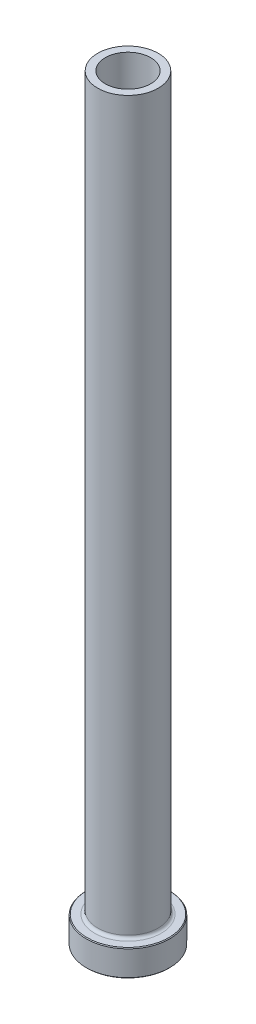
ISO-10303-21;
HEADER;
FILE_DESCRIPTION(('STEP AP214'),'2;1');
FILE_NAME('part.step','',(''),(''),'','','');
FILE_SCHEMA(('AUTOMOTIVE_DESIGN { 1 0 10303 214 1 1 1 1 }'));
ENDSEC;
DATA;
#1=APPLICATION_CONTEXT('core data for automotive mechanical design processes');
#2=APPLICATION_PROTOCOL_DEFINITION('international standard','automotive_design',2000,#1);
#3=PRODUCT_CONTEXT('',#1,'mechanical');
#4=PRODUCT('Part','Part','',(#3));
#5=PRODUCT_RELATED_PRODUCT_CATEGORY('part','',(#4));
#6=PRODUCT_DEFINITION_FORMATION('','',#4);
#7=PRODUCT_DEFINITION_CONTEXT('part definition',#1,'design');
#8=PRODUCT_DEFINITION('design','',#6,#7);
#9=PRODUCT_DEFINITION_SHAPE('','',#8);
#10=(LENGTH_UNIT() NAMED_UNIT(*) SI_UNIT(.MILLI.,.METRE.));
#11=(NAMED_UNIT(*) PLANE_ANGLE_UNIT() SI_UNIT($,.RADIAN.));
#12=(NAMED_UNIT(*) SI_UNIT($,.STERADIAN.) SOLID_ANGLE_UNIT());
#13=UNCERTAINTY_MEASURE_WITH_UNIT(LENGTH_MEASURE(1.E-05),#10,'distance_accuracy_value','');
#14=(GEOMETRIC_REPRESENTATION_CONTEXT(3) GLOBAL_UNCERTAINTY_ASSIGNED_CONTEXT((#13)) GLOBAL_UNIT_ASSIGNED_CONTEXT((#10,
#11,#12)) REPRESENTATION_CONTEXT('',''));
#15=CARTESIAN_POINT('',(0.,0.,0.));
#16=DIRECTION('',(0.,0.,1.));
#17=DIRECTION('',(1.,0.,0.));
#18=AXIS2_PLACEMENT_3D('',#15,#16,#17);
#19=CARTESIAN_POINT('',(0.,92.1876809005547,0.));
#20=DIRECTION('',(0.,1.,0.));
#21=DIRECTION('',(0.,0.,1.));
#22=AXIS2_PLACEMENT_3D('',#19,#20,#21);
#23=CYLINDRICAL_SURFACE('',#22,6.);
#24=CARTESIAN_POINT('',(0.,200.,0.));
#25=DIRECTION('',(0.,1.,0.));
#26=DIRECTION('',(0.,0.,1.));
#27=AXIS2_PLACEMENT_3D('',#24,#25,#26);
#28=CIRCLE('',#27,6.);
#29=CARTESIAN_POINT('',(0.,200.,6.));
#30=VERTEX_POINT('',#29);
#31=EDGE_CURVE('E62',#30,#30,#28,.T.);
#32=ORIENTED_EDGE('',*,*,#31,.T.);
#33=EDGE_LOOP('',(#32));
#34=FACE_BOUND('',#33,.T.);
#35=CARTESIAN_POINT('',(0.,145.,0.));
#36=DIRECTION('',(0.,1.,0.));
#37=DIRECTION('',(0.,0.,1.));
#38=AXIS2_PLACEMENT_3D('',#35,#36,#37);
#39=CIRCLE('',#38,6.);
#40=CARTESIAN_POINT('',(0.,145.,6.));
#41=VERTEX_POINT('',#40);
#42=EDGE_CURVE('E71',#41,#41,#39,.T.);
#43=ORIENTED_EDGE('',*,*,#42,.F.);
#44=EDGE_LOOP('',(#43));
#45=FACE_BOUND('',#44,.T.);
#46=ADVANCED_FACE('F30',(#34,#45),#23,.F.);
#47=CARTESIAN_POINT('',(-6.,200.,0.));
#48=DIRECTION('',(0.,1.,0.));
#49=DIRECTION('',(0.,0.,1.));
#50=AXIS2_PLACEMENT_3D('',#47,#48,#49);
#51=PLANE('',#50);
#52=CARTESIAN_POINT('',(0.,200.,0.));
#53=DIRECTION('',(0.,1.,0.));
#54=DIRECTION('',(0.,0.,1.));
#55=AXIS2_PLACEMENT_3D('',#52,#53,#54);
#56=CIRCLE('',#55,8.00000000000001);
#57=CARTESIAN_POINT('',(0.,200.,8.00000000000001));
#58=VERTEX_POINT('',#57);
#59=EDGE_CURVE('E65',#58,#58,#56,.T.);
#60=ORIENTED_EDGE('',*,*,#59,.T.);
#61=EDGE_LOOP('',(#60));
#62=FACE_BOUND('',#61,.T.);
#63=ORIENTED_EDGE('',*,*,#31,.F.);
#64=EDGE_LOOP('',(#63));
#65=FACE_BOUND('',#64,.T.);
#66=ADVANCED_FACE('F79',(#62,#65),#51,.T.);
#67=CARTESIAN_POINT('',(0.,92.1876809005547,0.));
#68=DIRECTION('',(0.,1.,0.));
#69=DIRECTION('',(0.,0.,1.));
#70=AXIS2_PLACEMENT_3D('',#67,#68,#69);
#71=CYLINDRICAL_SURFACE('',#70,8.);
#72=CARTESIAN_POINT('',(0.,7.8,0.));
#73=DIRECTION('',(0.,1.,0.));
#74=DIRECTION('',(0.,0.,1.));
#75=AXIS2_PLACEMENT_3D('',#72,#73,#74);
#76=CIRCLE('',#75,8.);
#77=CARTESIAN_POINT('',(0.,7.8,8.));
#78=VERTEX_POINT('',#77);
#79=EDGE_CURVE('E59',#78,#78,#76,.T.);
#80=ORIENTED_EDGE('',*,*,#79,.T.);
#81=EDGE_LOOP('',(#80));
#82=FACE_BOUND('',#81,.T.);
#83=ORIENTED_EDGE('',*,*,#59,.F.);
#84=EDGE_LOOP('',(#83));
#85=FACE_BOUND('',#84,.T.);
#86=ADVANCED_FACE('F85',(#82,#85),#71,.T.);
#87=CARTESIAN_POINT('',(-7.99999999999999,7.,0.));
#88=DIRECTION('',(0.,1.,0.));
#89=DIRECTION('',(0.,0.,1.));
#90=AXIS2_PLACEMENT_3D('',#87,#88,#89);
#91=PLANE('',#90);
#92=CARTESIAN_POINT('',(0.,7.,0.));
#93=DIRECTION('',(0.,1.,0.));
#94=DIRECTION('',(0.,0.,1.));
#95=AXIS2_PLACEMENT_3D('',#92,#93,#94);
#96=CIRCLE('',#95,10.8);
#97=CARTESIAN_POINT('',(0.,7.,10.8));
#98=VERTEX_POINT('',#97);
#99=EDGE_CURVE('E53',#98,#98,#96,.T.);
#100=ORIENTED_EDGE('',*,*,#99,.T.);
#101=EDGE_LOOP('',(#100));
#102=FACE_BOUND('',#101,.T.);
#103=CARTESIAN_POINT('',(0.,7.,0.));
#104=DIRECTION('',(0.,1.,0.));
#105=DIRECTION('',(0.,0.,1.));
#106=AXIS2_PLACEMENT_3D('',#103,#104,#105);
#107=CIRCLE('',#106,8.8);
#108=CARTESIAN_POINT('',(0.,7.,8.8));
#109=VERTEX_POINT('',#108);
#110=EDGE_CURVE('E56',#109,#109,#107,.F.);
#111=ORIENTED_EDGE('',*,*,#110,.T.);
#112=EDGE_LOOP('',(#111));
#113=FACE_BOUND('',#112,.T.);
#114=ADVANCED_FACE('F111',(#102,#113),#91,.T.);
#115=CARTESIAN_POINT('',(0.,92.1876809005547,0.));
#116=DIRECTION('',(0.,1.,0.));
#117=DIRECTION('',(0.,0.,1.));
#118=AXIS2_PLACEMENT_3D('',#115,#116,#117);
#119=CYLINDRICAL_SURFACE('',#118,11.);
#120=CARTESIAN_POINT('',(0.,6.79999999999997,0.));
#121=DIRECTION('',(0.,1.,0.));
#122=DIRECTION('',(0.,0.,1.));
#123=AXIS2_PLACEMENT_3D('',#120,#121,#122);
#124=CIRCLE('',#123,11.);
#125=CARTESIAN_POINT('',(0.,6.79999999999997,11.));
#126=VERTEX_POINT('',#125);
#127=EDGE_CURVE('E45',#126,#126,#124,.F.);
#128=ORIENTED_EDGE('',*,*,#127,.T.);
#129=EDGE_LOOP('',(#128));
#130=FACE_BOUND('',#129,.T.);
#131=CARTESIAN_POINT('',(0.,0.200000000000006,0.));
#132=DIRECTION('',(0.,-1.,0.));
#133=DIRECTION('',(0.,0.,-1.));
#134=AXIS2_PLACEMENT_3D('',#131,#132,#133);
#135=CIRCLE('',#134,11.);
#136=CARTESIAN_POINT('',(0.,0.200000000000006,-11.));
#137=VERTEX_POINT('',#136);
#138=EDGE_CURVE('E50',#137,#137,#135,.F.);
#139=ORIENTED_EDGE('',*,*,#138,.T.);
#140=EDGE_LOOP('',(#139));
#141=FACE_BOUND('',#140,.T.);
#142=ADVANCED_FACE('F108',(#130,#141),#119,.T.);
#143=CARTESIAN_POINT('',(-11.,0.,0.));
#144=DIRECTION('',(0.,-1.,0.));
#145=DIRECTION('',(0.,0.,-1.));
#146=AXIS2_PLACEMENT_3D('',#143,#144,#145);
#147=PLANE('',#146);
#148=CARTESIAN_POINT('',(0.,0.,0.));
#149=DIRECTION('',(0.,-1.,0.));
#150=DIRECTION('',(0.,0.,-1.));
#151=AXIS2_PLACEMENT_3D('',#148,#149,#150);
#152=CIRCLE('',#151,6.75000000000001);
#153=CARTESIAN_POINT('',(0.,0.,-6.75000000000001));
#154=VERTEX_POINT('',#153);
#155=EDGE_CURVE('E37',#154,#154,#152,.F.);
#156=ORIENTED_EDGE('',*,*,#155,.T.);
#157=EDGE_LOOP('',(#156));
#158=FACE_BOUND('',#157,.T.);
#159=CARTESIAN_POINT('',(0.,0.,0.));
#160=DIRECTION('',(0.,-1.,0.));
#161=DIRECTION('',(0.,0.,-1.));
#162=AXIS2_PLACEMENT_3D('',#159,#160,#161);
#163=CIRCLE('',#162,10.8);
#164=CARTESIAN_POINT('',(0.,0.,-10.8));
#165=VERTEX_POINT('',#164);
#166=EDGE_CURVE('E41',#165,#165,#163,.T.);
#167=ORIENTED_EDGE('',*,*,#166,.T.);
#168=EDGE_LOOP('',(#167));
#169=FACE_BOUND('',#168,.T.);
#170=ADVANCED_FACE('F110',(#158,#169),#147,.T.);
#171=CARTESIAN_POINT('',(0.,92.1876809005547,0.));
#172=DIRECTION('',(0.,1.,0.));
#173=DIRECTION('',(0.,0.,1.));
#174=AXIS2_PLACEMENT_3D('',#171,#172,#173);
#175=CYLINDRICAL_SURFACE('',#174,6.25);
#176=CARTESIAN_POINT('',(0.,0.500000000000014,0.));
#177=DIRECTION('',(0.,-1.,0.));
#178=DIRECTION('',(0.,0.,-1.));
#179=AXIS2_PLACEMENT_3D('',#176,#177,#178);
#180=CIRCLE('',#179,6.25);
#181=CARTESIAN_POINT('',(0.,0.500000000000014,-6.25));
#182=VERTEX_POINT('',#181);
#183=EDGE_CURVE('E10',#182,#182,#180,.T.);
#184=ORIENTED_EDGE('',*,*,#183,.T.);
#185=EDGE_LOOP('',(#184));
#186=FACE_BOUND('',#185,.T.);
#187=CARTESIAN_POINT('',(0.,133.,0.));
#188=DIRECTION('',(0.,1.,0.));
#189=DIRECTION('',(0.,0.,1.));
#190=AXIS2_PLACEMENT_3D('',#187,#188,#189);
#191=CIRCLE('',#190,6.25000000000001);
#192=CARTESIAN_POINT('',(0.,133.,6.25000000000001));
#193=VERTEX_POINT('',#192);
#194=EDGE_CURVE('E68',#193,#193,#191,.T.);
#195=ORIENTED_EDGE('',*,*,#194,.T.);
#196=EDGE_LOOP('',(#195));
#197=FACE_BOUND('',#196,.T.);
#198=ADVANCED_FACE('F118',(#186,#197),#175,.F.);
#199=CARTESIAN_POINT('',(0.,133.,0.));
#200=DIRECTION('',(0.,-1.,0.));
#201=DIRECTION('',(0.,0.,-1.));
#202=AXIS2_PLACEMENT_3D('',#199,#200,#201);
#203=CONICAL_SURFACE('',#202,6.25000000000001,0.0208303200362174);
#204=ORIENTED_EDGE('',*,*,#42,.T.);
#205=EDGE_LOOP('',(#204));
#206=FACE_BOUND('',#205,.T.);
#207=ORIENTED_EDGE('',*,*,#194,.F.);
#208=EDGE_LOOP('',(#207));
#209=FACE_BOUND('',#208,.T.);
#210=ADVANCED_FACE('F75',(#206,#209),#203,.F.);
#211=CARTESIAN_POINT('',(0.,7.8,0.));
#212=DIRECTION('',(0.,1.,0.));
#213=DIRECTION('',(0.,0.,1.));
#214=AXIS2_PLACEMENT_3D('',#211,#212,#213);
#215=TOROIDAL_SURFACE('',#214,8.8,0.8);
#216=ORIENTED_EDGE('',*,*,#110,.F.);
#217=EDGE_LOOP('',(#216));
#218=FACE_BOUND('',#217,.T.);
#219=ORIENTED_EDGE('',*,*,#79,.F.);
#220=EDGE_LOOP('',(#219));
#221=FACE_BOUND('',#220,.T.);
#222=ADVANCED_FACE('F90',(#218,#221),#215,.F.);
#223=CARTESIAN_POINT('',(0.,7.00000000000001,0.));
#224=DIRECTION('',(0.,-1.,0.));
#225=DIRECTION('',(0.,0.,-1.));
#226=AXIS2_PLACEMENT_3D('',#223,#224,#225);
#227=CONICAL_SURFACE('',#226,10.7999999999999,0.785398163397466);
#228=ORIENTED_EDGE('',*,*,#127,.F.);
#229=EDGE_LOOP('',(#228));
#230=FACE_BOUND('',#229,.T.);
#231=ORIENTED_EDGE('',*,*,#99,.F.);
#232=EDGE_LOOP('',(#231));
#233=FACE_BOUND('',#232,.T.);
#234=ADVANCED_FACE('F93',(#230,#233),#227,.T.);
#235=CARTESIAN_POINT('',(0.,0.200000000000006,0.));
#236=DIRECTION('',(0.,1.,0.));
#237=DIRECTION('',(0.,0.,1.));
#238=AXIS2_PLACEMENT_3D('',#235,#236,#237);
#239=CONICAL_SURFACE('',#238,11.,0.785398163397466);
#240=ORIENTED_EDGE('',*,*,#166,.F.);
#241=EDGE_LOOP('',(#240));
#242=FACE_BOUND('',#241,.T.);
#243=ORIENTED_EDGE('',*,*,#138,.F.);
#244=EDGE_LOOP('',(#243));
#245=FACE_BOUND('',#244,.T.);
#246=ADVANCED_FACE('F96',(#242,#245),#239,.T.);
#247=CARTESIAN_POINT('',(0.,0.,0.));
#248=DIRECTION('',(0.,-1.,0.));
#249=DIRECTION('',(0.,0.,-1.));
#250=AXIS2_PLACEMENT_3D('',#247,#248,#249);
#251=CONICAL_SURFACE('',#250,6.75000000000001,0.785398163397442);
#252=ORIENTED_EDGE('',*,*,#183,.F.);
#253=EDGE_LOOP('',(#252));
#254=FACE_BOUND('',#253,.T.);
#255=ORIENTED_EDGE('',*,*,#155,.F.);
#256=EDGE_LOOP('',(#255));
#257=FACE_BOUND('',#256,.T.);
#258=ADVANCED_FACE('F32',(#254,#257),#251,.F.);
#259=CLOSED_SHELL('',(#46,#66,#86,#114,#142,#170,#198,#210,#222,#234,#246,#258));
#260=MANIFOLD_SOLID_BREP('B2',#259);
#261=ADVANCED_BREP_SHAPE_REPRESENTATION('',(#18,#260),#14);
#262=SHAPE_DEFINITION_REPRESENTATION(#9,#261);
ENDSEC;
END-ISO-10303-21;
